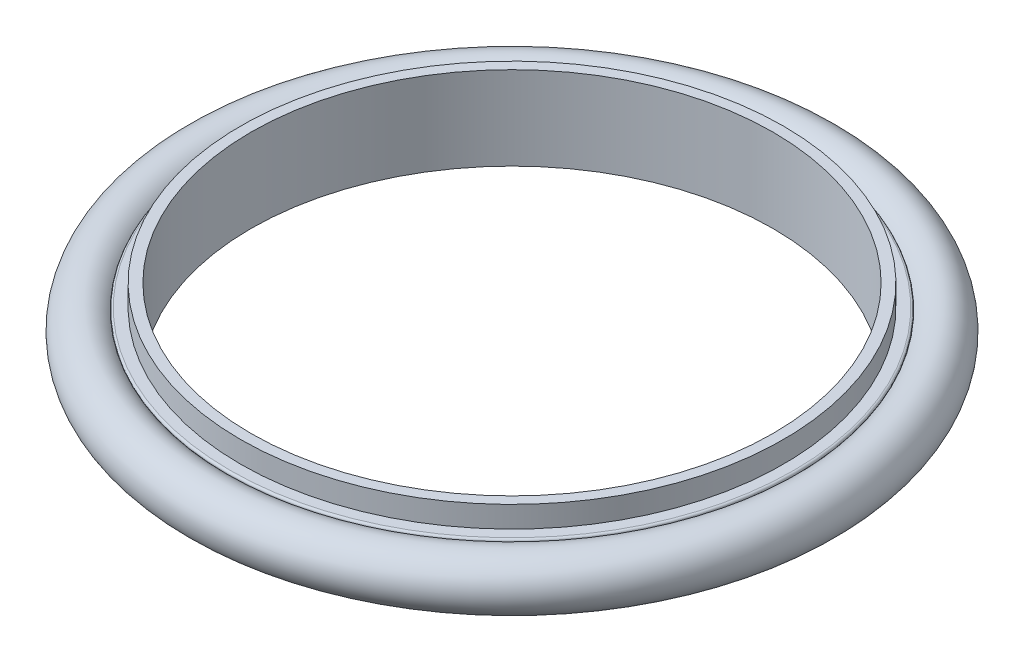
ISO-10303-21;
HEADER;
FILE_DESCRIPTION(('STEP AP214'),'2;1');
FILE_NAME('part.step','',(''),(''),'','','');
FILE_SCHEMA(('AUTOMOTIVE_DESIGN { 1 0 10303 214 1 1 1 1 }'));
ENDSEC;
DATA;
#1=APPLICATION_CONTEXT('core data for automotive mechanical design processes');
#2=APPLICATION_PROTOCOL_DEFINITION('international standard','automotive_design',2000,#1);
#3=PRODUCT_CONTEXT('',#1,'mechanical');
#4=PRODUCT('Part','Part','',(#3));
#5=PRODUCT_RELATED_PRODUCT_CATEGORY('part','',(#4));
#6=PRODUCT_DEFINITION_FORMATION('','',#4);
#7=PRODUCT_DEFINITION_CONTEXT('part definition',#1,'design');
#8=PRODUCT_DEFINITION('design','',#6,#7);
#9=PRODUCT_DEFINITION_SHAPE('','',#8);
#10=(LENGTH_UNIT() NAMED_UNIT(*) SI_UNIT(.MILLI.,.METRE.));
#11=(NAMED_UNIT(*) PLANE_ANGLE_UNIT() SI_UNIT($,.RADIAN.));
#12=(NAMED_UNIT(*) SI_UNIT($,.STERADIAN.) SOLID_ANGLE_UNIT());
#13=UNCERTAINTY_MEASURE_WITH_UNIT(LENGTH_MEASURE(1.E-05),#10,'distance_accuracy_value','');
#14=(GEOMETRIC_REPRESENTATION_CONTEXT(3) GLOBAL_UNCERTAINTY_ASSIGNED_CONTEXT((#13)) GLOBAL_UNIT_ASSIGNED_CONTEXT((#10,
#11,#12)) REPRESENTATION_CONTEXT('',''));
#15=CARTESIAN_POINT('',(0.,0.,0.));
#16=DIRECTION('',(0.,0.,1.));
#17=DIRECTION('',(1.,0.,0.));
#18=AXIS2_PLACEMENT_3D('',#15,#16,#17);
#19=CARTESIAN_POINT('',(0.,0.,0.));
#20=DIRECTION('',(0.,1.,0.));
#21=DIRECTION('',(0.,0.,1.));
#22=AXIS2_PLACEMENT_3D('',#19,#20,#21);
#23=TOROIDAL_SURFACE('',#22,29.0644487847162,2.5);
#24=CARTESIAN_POINT('',(0.,1.62037037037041,0.));
#25=DIRECTION('',(0.,1.,0.));
#26=DIRECTION('',(0.,0.,1.));
#27=AXIS2_PLACEMENT_3D('',#24,#25,#26);
#28=CIRCLE('',#27,27.160663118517);
#29=CARTESIAN_POINT('',(0.,1.62037037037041,27.160663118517));
#30=VERTEX_POINT('',#29);
#31=EDGE_CURVE('P0_E106',#30,#30,#28,.T.);
#32=ORIENTED_EDGE('',*,*,#31,.F.);
#33=EDGE_LOOP('',(#32));
#34=FACE_BOUND('',#33,.T.);
#35=CARTESIAN_POINT('',(0.,-1.62037037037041,0.));
#36=DIRECTION('',(0.,1.,0.));
#37=DIRECTION('',(0.,0.,1.));
#38=AXIS2_PLACEMENT_3D('',#35,#36,#37);
#39=CIRCLE('',#38,27.160663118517);
#40=CARTESIAN_POINT('',(0.,-1.62037037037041,27.160663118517));
#41=VERTEX_POINT('',#40);
#42=EDGE_CURVE('P0_E59',#41,#41,#39,.F.);
#43=ORIENTED_EDGE('',*,*,#42,.F.);
#44=EDGE_LOOP('',(#43));
#45=FACE_BOUND('',#44,.T.);
#46=ADVANCED_FACE('P0_F17',(#34,#45),#23,.F.);
#47=CARTESIAN_POINT('',(0.,1.75,0.));
#48=DIRECTION('',(0.,1.,0.));
#49=DIRECTION('',(0.,0.,1.));
#50=AXIS2_PLACEMENT_3D('',#47,#48,#49);
#51=TOROIDAL_SURFACE('',#50,27.008360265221,0.2);
#52=CARTESIAN_POINT('',(0.,1.95,0.));
#53=DIRECTION('',(0.,-1.,0.));
#54=DIRECTION('',(0.,0.,1.));
#55=AXIS2_PLACEMENT_3D('',#52,#53,#54);
#56=CIRCLE('',#55,27.008360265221);
#57=CARTESIAN_POINT('',(0.,1.95,27.008360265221));
#58=VERTEX_POINT('',#57);
#59=CARTESIAN_POINT('',(0.,1.95,-27.008360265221));
#60=VERTEX_POINT('',#59);
#61=EDGE_CURVE('P0_E45',#58,#60,#56,.T.);
#62=ORIENTED_EDGE('',*,*,#61,.T.);
#63=CARTESIAN_POINT('',(0.,1.95,0.));
#64=DIRECTION('',(0.,-1.,0.));
#65=DIRECTION('',(0.,0.,-1.));
#66=AXIS2_PLACEMENT_3D('',#63,#64,#65);
#67=CIRCLE('',#66,27.008360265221);
#68=EDGE_CURVE('P0_E48',#60,#58,#67,.T.);
#69=ORIENTED_EDGE('',*,*,#68,.T.);
#70=EDGE_LOOP('',(#62,#69));
#71=FACE_BOUND('',#70,.T.);
#72=ORIENTED_EDGE('',*,*,#31,.T.);
#73=EDGE_LOOP('',(#72));
#74=FACE_BOUND('',#73,.T.);
#75=ADVANCED_FACE('P0_F57',(#71,#74),#51,.T.);
#76=CARTESIAN_POINT('',(0.,-1.75,0.));
#77=DIRECTION('',(0.,1.,0.));
#78=DIRECTION('',(0.,0.,1.));
#79=AXIS2_PLACEMENT_3D('',#76,#77,#78);
#80=TOROIDAL_SURFACE('',#79,27.008360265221,0.2);
#81=ORIENTED_EDGE('',*,*,#42,.T.);
#82=EDGE_LOOP('',(#81));
#83=FACE_BOUND('',#82,.T.);
#84=CARTESIAN_POINT('',(0.,-1.95,0.));
#85=DIRECTION('',(0.,1.,0.));
#86=DIRECTION('',(0.,0.,1.));
#87=AXIS2_PLACEMENT_3D('',#84,#85,#86);
#88=CIRCLE('',#87,27.008360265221);
#89=CARTESIAN_POINT('',(0.,-1.95,27.0083602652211));
#90=VERTEX_POINT('',#89);
#91=CARTESIAN_POINT('',(0.,-1.95,-27.008360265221));
#92=VERTEX_POINT('',#91);
#93=EDGE_CURVE('P0_E36',#90,#92,#88,.T.);
#94=ORIENTED_EDGE('',*,*,#93,.T.);
#95=CARTESIAN_POINT('',(0.,-1.95,0.));
#96=DIRECTION('',(0.,1.,0.));
#97=DIRECTION('',(0.,0.,-1.));
#98=AXIS2_PLACEMENT_3D('',#95,#96,#97);
#99=CIRCLE('',#98,27.008360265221);
#100=EDGE_CURVE('P0_E54',#92,#90,#99,.T.);
#101=ORIENTED_EDGE('',*,*,#100,.T.);
#102=EDGE_LOOP('',(#94,#101));
#103=FACE_BOUND('',#102,.T.);
#104=ADVANCED_FACE('P0_F66',(#83,#103),#80,.T.);
#105=CARTESIAN_POINT('',(27.0083602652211,1.94999999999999,0.));
#106=DIRECTION('',(0.,-1.,0.));
#107=DIRECTION('',(0.,0.,-1.));
#108=AXIS2_PLACEMENT_3D('',#105,#106,#107);
#109=PLANE('',#108);
#110=ORIENTED_EDGE('',*,*,#61,.F.);
#111=ORIENTED_EDGE('',*,*,#68,.F.);
#112=EDGE_LOOP('',(#110,#111));
#113=FACE_BOUND('',#112,.T.);
#114=CARTESIAN_POINT('',(0.,1.94999999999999,0.));
#115=DIRECTION('',(0.,1.,0.));
#116=DIRECTION('',(0.,0.,1.));
#117=AXIS2_PLACEMENT_3D('',#114,#115,#116);
#118=CIRCLE('',#117,26.0000000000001);
#119=CARTESIAN_POINT('',(0.,1.94999999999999,26.0000000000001));
#120=VERTEX_POINT('',#119);
#121=EDGE_CURVE('P0_E121',#120,#120,#118,.T.);
#122=ORIENTED_EDGE('',*,*,#121,.F.);
#123=EDGE_LOOP('',(#122));
#124=FACE_BOUND('',#123,.T.);
#125=ADVANCED_FACE('P0_F50',(#113,#124),#109,.F.);
#126=CARTESIAN_POINT('',(26.0000000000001,-1.94999999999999,0.));
#127=DIRECTION('',(0.,1.,0.));
#128=DIRECTION('',(0.,0.,1.));
#129=AXIS2_PLACEMENT_3D('',#126,#127,#128);
#130=PLANE('',#129);
#131=CARTESIAN_POINT('',(0.,-1.95000000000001,0.));
#132=DIRECTION('',(0.,1.,0.));
#133=DIRECTION('',(0.,0.,1.));
#134=AXIS2_PLACEMENT_3D('',#131,#132,#133);
#135=CIRCLE('',#134,26.0000000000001);
#136=CARTESIAN_POINT('',(0.,-1.95000000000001,26.0000000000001));
#137=VERTEX_POINT('',#136);
#138=EDGE_CURVE('P0_E119',#137,#137,#135,.F.);
#139=ORIENTED_EDGE('',*,*,#138,.F.);
#140=EDGE_LOOP('',(#139));
#141=FACE_BOUND('',#140,.T.);
#142=ORIENTED_EDGE('',*,*,#100,.F.);
#143=ORIENTED_EDGE('',*,*,#93,.F.);
#144=EDGE_LOOP('',(#142,#143));
#145=FACE_BOUND('',#144,.T.);
#146=ADVANCED_FACE('P0_F126',(#141,#145),#130,.F.);
#147=CARTESIAN_POINT('',(0.,7.68419061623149,0.));
#148=DIRECTION('',(0.,1.,0.));
#149=DIRECTION('',(0.,0.,1.));
#150=AXIS2_PLACEMENT_3D('',#147,#148,#149);
#151=CYLINDRICAL_SURFACE('',#150,26.0000000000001);
#152=CARTESIAN_POINT('',(0.,4.,0.));
#153=DIRECTION('',(0.,1.,0.));
#154=DIRECTION('',(0.,0.,1.));
#155=AXIS2_PLACEMENT_3D('',#152,#153,#154);
#156=CIRCLE('',#155,26.0000000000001);
#157=CARTESIAN_POINT('',(0.,4.,26.0000000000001));
#158=VERTEX_POINT('',#157);
#159=EDGE_CURVE('P0_E116',#158,#158,#156,.F.);
#160=ORIENTED_EDGE('',*,*,#159,.T.);
#161=EDGE_LOOP('',(#160));
#162=FACE_BOUND('',#161,.T.);
#163=ORIENTED_EDGE('',*,*,#121,.T.);
#164=EDGE_LOOP('',(#163));
#165=FACE_BOUND('',#164,.T.);
#166=ADVANCED_FACE('P0_F139',(#162,#165),#151,.T.);
#167=CARTESIAN_POINT('',(0.,7.68419061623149,0.));
#168=DIRECTION('',(0.,1.,0.));
#169=DIRECTION('',(0.,0.,1.));
#170=AXIS2_PLACEMENT_3D('',#167,#168,#169);
#171=CYLINDRICAL_SURFACE('',#170,26.0000000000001);
#172=ORIENTED_EDGE('',*,*,#138,.T.);
#173=EDGE_LOOP('',(#172));
#174=FACE_BOUND('',#173,.T.);
#175=CARTESIAN_POINT('',(0.,-4.,0.));
#176=DIRECTION('',(0.,1.,0.));
#177=DIRECTION('',(0.,0.,1.));
#178=AXIS2_PLACEMENT_3D('',#175,#176,#177);
#179=CIRCLE('',#178,26.0000000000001);
#180=CARTESIAN_POINT('',(0.,-4.,26.0000000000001));
#181=VERTEX_POINT('',#180);
#182=EDGE_CURVE('P0_E113',#181,#181,#179,.T.);
#183=ORIENTED_EDGE('',*,*,#182,.T.);
#184=EDGE_LOOP('',(#183));
#185=FACE_BOUND('',#184,.T.);
#186=ADVANCED_FACE('P0_F158',(#174,#185),#171,.T.);
#187=CARTESIAN_POINT('',(26.0000000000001,4.,0.));
#188=DIRECTION('',(0.,-1.,0.));
#189=DIRECTION('',(0.,0.,-1.));
#190=AXIS2_PLACEMENT_3D('',#187,#188,#189);
#191=PLANE('',#190);
#192=ORIENTED_EDGE('',*,*,#159,.F.);
#193=EDGE_LOOP('',(#192));
#194=FACE_BOUND('',#193,.T.);
#195=CARTESIAN_POINT('',(0.,4.,0.));
#196=DIRECTION('',(0.,1.,0.));
#197=DIRECTION('',(0.,0.,1.));
#198=AXIS2_PLACEMENT_3D('',#195,#196,#197);
#199=CIRCLE('',#198,25.0000000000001);
#200=CARTESIAN_POINT('',(0.,4.,25.0000000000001));
#201=VERTEX_POINT('',#200);
#202=EDGE_CURVE('P0_E28',#201,#201,#199,.F.);
#203=ORIENTED_EDGE('',*,*,#202,.T.);
#204=EDGE_LOOP('',(#203));
#205=FACE_BOUND('',#204,.T.);
#206=ADVANCED_FACE('P0_F162',(#194,#205),#191,.F.);
#207=CARTESIAN_POINT('',(25.0000000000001,-4.,0.));
#208=DIRECTION('',(0.,1.,0.));
#209=DIRECTION('',(0.,0.,1.));
#210=AXIS2_PLACEMENT_3D('',#207,#208,#209);
#211=PLANE('',#210);
#212=CARTESIAN_POINT('',(0.,-4.,0.));
#213=DIRECTION('',(0.,1.,0.));
#214=DIRECTION('',(0.,0.,1.));
#215=AXIS2_PLACEMENT_3D('',#212,#213,#214);
#216=CIRCLE('',#215,25.0000000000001);
#217=CARTESIAN_POINT('',(0.,-4.,25.0000000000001));
#218=VERTEX_POINT('',#217);
#219=EDGE_CURVE('P0_E11',#218,#218,#216,.T.);
#220=ORIENTED_EDGE('',*,*,#219,.T.);
#221=EDGE_LOOP('',(#220));
#222=FACE_BOUND('',#221,.T.);
#223=ORIENTED_EDGE('',*,*,#182,.F.);
#224=EDGE_LOOP('',(#223));
#225=FACE_BOUND('',#224,.T.);
#226=ADVANCED_FACE('P0_F166',(#222,#225),#211,.F.);
#227=CARTESIAN_POINT('',(0.,7.68419061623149,0.));
#228=DIRECTION('',(0.,1.,0.));
#229=DIRECTION('',(0.,0.,1.));
#230=AXIS2_PLACEMENT_3D('',#227,#228,#229);
#231=CYLINDRICAL_SURFACE('',#230,25.0000000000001);
#232=ORIENTED_EDGE('',*,*,#202,.F.);
#233=EDGE_LOOP('',(#232));
#234=FACE_BOUND('',#233,.T.);
#235=ORIENTED_EDGE('',*,*,#219,.F.);
#236=EDGE_LOOP('',(#235));
#237=FACE_BOUND('',#236,.T.);
#238=ADVANCED_FACE('P0_F170',(#234,#237),#231,.F.);
#239=CLOSED_SHELL('',(#46,#75,#104,#125,#146,#166,#186,#206,#226,#238));
#240=MANIFOLD_SOLID_BREP('P0_B1',#239);
#241=CARTESIAN_POINT('',(0.,0.,0.));
#242=DIRECTION('',(0.,1.,0.));
#243=DIRECTION('',(0.,0.,1.));
#244=AXIS2_PLACEMENT_3D('',#241,#242,#243);
#245=TOROIDAL_SURFACE('',#244,29.0644487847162,2.5);
#246=ADVANCED_FACE('P1_F14',(),#245,.T.);
#247=CLOSED_SHELL('',(#246));
#248=MANIFOLD_SOLID_BREP('P1_B1',#247);
#249=ADVANCED_BREP_SHAPE_REPRESENTATION('',(#18,#240,#248),#14);
#250=SHAPE_DEFINITION_REPRESENTATION(#9,#249);
ENDSEC;
END-ISO-10303-21;
